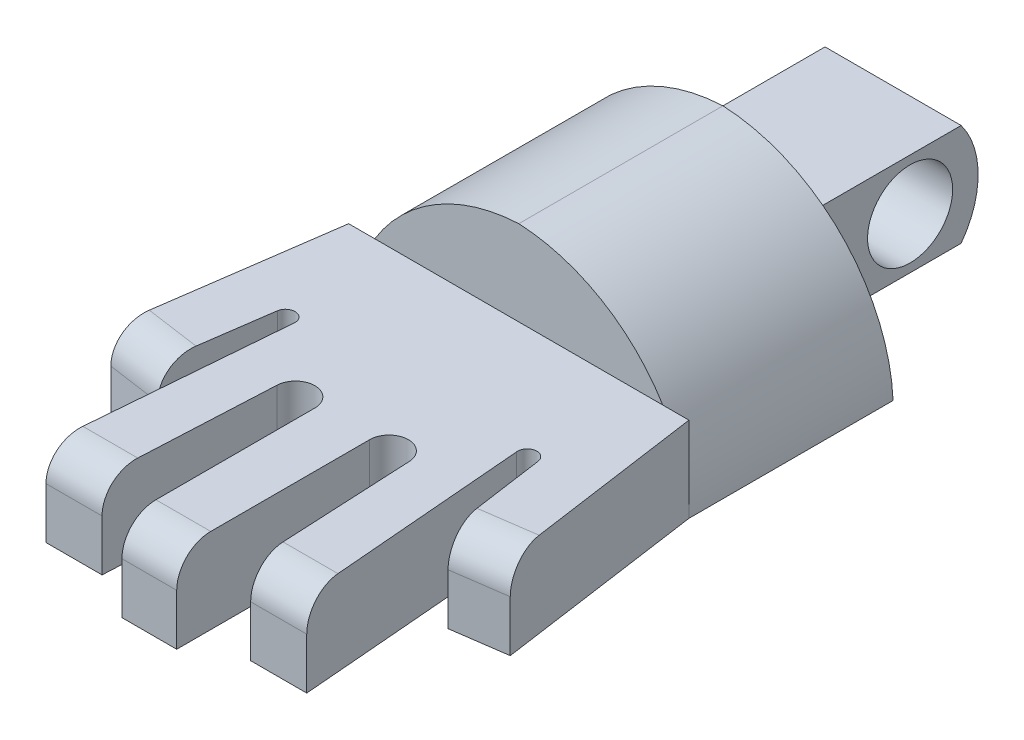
ISO-10303-21;
HEADER;
FILE_DESCRIPTION(('STEP AP214'),'2;1');
FILE_NAME('part.step','',(''),(''),'','','');
FILE_SCHEMA(('AUTOMOTIVE_DESIGN { 1 0 10303 214 1 1 1 1 }'));
ENDSEC;
DATA;
#1=APPLICATION_CONTEXT('core data for automotive mechanical design processes');
#2=APPLICATION_PROTOCOL_DEFINITION('international standard','automotive_design',2000,#1);
#3=PRODUCT_CONTEXT('',#1,'mechanical');
#4=PRODUCT('Part','Part','',(#3));
#5=PRODUCT_RELATED_PRODUCT_CATEGORY('part','',(#4));
#6=PRODUCT_DEFINITION_FORMATION('','',#4);
#7=PRODUCT_DEFINITION_CONTEXT('part definition',#1,'design');
#8=PRODUCT_DEFINITION('design','',#6,#7);
#9=PRODUCT_DEFINITION_SHAPE('','',#8);
#10=(LENGTH_UNIT() NAMED_UNIT(*) SI_UNIT(.MILLI.,.METRE.));
#11=(NAMED_UNIT(*) PLANE_ANGLE_UNIT() SI_UNIT($,.RADIAN.));
#12=(NAMED_UNIT(*) SI_UNIT($,.STERADIAN.) SOLID_ANGLE_UNIT());
#13=UNCERTAINTY_MEASURE_WITH_UNIT(LENGTH_MEASURE(1.E-05),#10,'distance_accuracy_value','');
#14=(GEOMETRIC_REPRESENTATION_CONTEXT(3) GLOBAL_UNCERTAINTY_ASSIGNED_CONTEXT((#13)) GLOBAL_UNIT_ASSIGNED_CONTEXT((#10,
#11,#12)) REPRESENTATION_CONTEXT('',''));
#15=CARTESIAN_POINT('',(0.,0.,0.));
#16=DIRECTION('',(0.,0.,1.));
#17=DIRECTION('',(1.,0.,0.));
#18=AXIS2_PLACEMENT_3D('',#15,#16,#17);
#19=CARTESIAN_POINT('',(0.482716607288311,-0.482716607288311,0.));
#20=DIRECTION('',(0.,0.,1.));
#21=DIRECTION('',(1.,0.,0.));
#22=AXIS2_PLACEMENT_3D('',#19,#20,#21);
#23=PLANE('',#22);
#24=DIRECTION('',(0.,-1.,0.));
#25=VECTOR('',#24,1.);
#26=CARTESIAN_POINT('',(4.,6.,0.));
#27=LINE('',#26,#25);
#28=CARTESIAN_POINT('',(4.,6.,0.));
#29=VERTEX_POINT('',#28);
#30=CARTESIAN_POINT('',(4.,0.,0.));
#31=VERTEX_POINT('',#30);
#32=EDGE_CURVE('E291',#29,#31,#27,.T.);
#33=ORIENTED_EDGE('',*,*,#32,.F.);
#34=DIRECTION('',(1.,0.,0.));
#35=VECTOR('',#34,1.);
#36=CARTESIAN_POINT('',(-4.,6.,0.));
#37=LINE('',#36,#35);
#38=CARTESIAN_POINT('',(-4.,6.,0.));
#39=VERTEX_POINT('',#38);
#40=EDGE_CURVE('E333',#39,#29,#37,.T.);
#41=ORIENTED_EDGE('',*,*,#40,.F.);
#42=DIRECTION('',(0.,-1.,0.));
#43=VECTOR('',#42,1.);
#44=CARTESIAN_POINT('',(-4.,6.,0.));
#45=LINE('',#44,#43);
#46=CARTESIAN_POINT('',(-4.,0.,0.));
#47=VERTEX_POINT('',#46);
#48=EDGE_CURVE('E316',#39,#47,#45,.T.);
#49=ORIENTED_EDGE('',*,*,#48,.T.);
#50=DIRECTION('',(1.,0.,0.));
#51=VECTOR('',#50,1.);
#52=CARTESIAN_POINT('',(10.,0.,0.));
#53=LINE('',#52,#51);
#54=CARTESIAN_POINT('',(-10.,0.,0.));
#55=VERTEX_POINT('',#54);
#56=EDGE_CURVE('E355',#55,#47,#53,.T.);
#57=ORIENTED_EDGE('',*,*,#56,.F.);
#58=CARTESIAN_POINT('',(0.482716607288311,-0.482716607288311,0.));
#59=DIRECTION('',(0.,0.,1.));
#60=DIRECTION('',(1.,0.,0.));
#61=AXIS2_PLACEMENT_3D('',#58,#59,#60);
#62=CIRCLE('',#61,10.4938249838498);
#63=CARTESIAN_POINT('',(0.,10.,0.));
#64=VERTEX_POINT('',#63);
#65=EDGE_CURVE('E336',#64,#55,#62,.T.);
#66=ORIENTED_EDGE('',*,*,#65,.F.);
#67=CARTESIAN_POINT('',(-0.482716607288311,-0.482716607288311,0.));
#68=DIRECTION('',(0.,0.,1.));
#69=DIRECTION('',(-1.,0.,0.));
#70=AXIS2_PLACEMENT_3D('',#67,#68,#69);
#71=CIRCLE('',#70,10.4938249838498);
#72=CARTESIAN_POINT('',(10.,0.,0.));
#73=VERTEX_POINT('',#72);
#74=EDGE_CURVE('E359',#73,#64,#71,.T.);
#75=ORIENTED_EDGE('',*,*,#74,.F.);
#76=EDGE_CURVE('E354',#31,#73,#53,.T.);
#77=ORIENTED_EDGE('',*,*,#76,.F.);
#78=EDGE_LOOP('',(#33,#41,#49,#57,#66,#75,#77));
#79=FACE_BOUND('',#78,.T.);
#80=ADVANCED_FACE('F45',(#79),#23,.F.);
#81=CARTESIAN_POINT('',(0.482716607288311,-0.482716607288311,12.));
#82=DIRECTION('',(0.,0.,-1.));
#83=DIRECTION('',(-1.,0.,0.));
#84=AXIS2_PLACEMENT_3D('',#81,#82,#83);
#85=CYLINDRICAL_SURFACE('',#84,10.4938249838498);
#86=ORIENTED_EDGE('',*,*,#65,.T.);
#87=DIRECTION('',(0.,0.,-1.));
#88=VECTOR('',#87,1.);
#89=CARTESIAN_POINT('',(-10.,0.,12.));
#90=LINE('',#89,#88);
#91=CARTESIAN_POINT('',(-10.,0.,12.));
#92=VERTEX_POINT('',#91);
#93=EDGE_CURVE('E369',#92,#55,#90,.T.);
#94=ORIENTED_EDGE('',*,*,#93,.F.);
#95=CARTESIAN_POINT('',(0.482716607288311,-0.482716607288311,12.));
#96=DIRECTION('',(0.,0.,1.));
#97=DIRECTION('',(1.,0.,0.));
#98=AXIS2_PLACEMENT_3D('',#95,#96,#97);
#99=CIRCLE('',#98,10.4938249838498);
#100=CARTESIAN_POINT('',(-8.46491891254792,5.,12.));
#101=VERTEX_POINT('',#100);
#102=EDGE_CURVE('E282',#101,#92,#99,.T.);
#103=ORIENTED_EDGE('',*,*,#102,.F.);
#104=CARTESIAN_POINT('',(0.,10.,12.));
#105=VERTEX_POINT('',#104);
#106=EDGE_CURVE('E342',#105,#101,#99,.T.);
#107=ORIENTED_EDGE('',*,*,#106,.F.);
#108=DIRECTION('',(0.,0.,-1.));
#109=VECTOR('',#108,1.);
#110=CARTESIAN_POINT('',(0.,10.,12.));
#111=LINE('',#110,#109);
#112=EDGE_CURVE('E350',#105,#64,#111,.T.);
#113=ORIENTED_EDGE('',*,*,#112,.T.);
#114=EDGE_LOOP('',(#86,#94,#103,#107,#113));
#115=FACE_BOUND('',#114,.T.);
#116=ADVANCED_FACE('F448',(#115),#85,.T.);
#117=CARTESIAN_POINT('',(10.,0.,12.));
#118=DIRECTION('',(0.,1.,0.));
#119=DIRECTION('',(0.,0.,1.));
#120=AXIS2_PLACEMENT_3D('',#117,#118,#119);
#121=PLANE('',#120);
#122=ORIENTED_EDGE('',*,*,#56,.T.);
#123=DIRECTION('',(0.,0.,-1.));
#124=VECTOR('',#123,1.);
#125=CARTESIAN_POINT('',(-4.,0.,0.));
#126=LINE('',#125,#124);
#127=CARTESIAN_POINT('',(-4.,0.,-10.));
#128=VERTEX_POINT('',#127);
#129=EDGE_CURVE('E320',#47,#128,#126,.T.);
#130=ORIENTED_EDGE('',*,*,#129,.T.);
#131=DIRECTION('',(1.,0.,0.));
#132=VECTOR('',#131,1.);
#133=CARTESIAN_POINT('',(-4.,0.,-10.));
#134=LINE('',#133,#132);
#135=CARTESIAN_POINT('',(4.,0.,-10.));
#136=VERTEX_POINT('',#135);
#137=EDGE_CURVE('E332',#128,#136,#134,.T.);
#138=ORIENTED_EDGE('',*,*,#137,.T.);
#139=DIRECTION('',(0.,0.,-1.));
#140=VECTOR('',#139,1.);
#141=CARTESIAN_POINT('',(4.,0.,0.));
#142=LINE('',#141,#140);
#143=EDGE_CURVE('E300',#31,#136,#142,.T.);
#144=ORIENTED_EDGE('',*,*,#143,.F.);
#145=ORIENTED_EDGE('',*,*,#76,.T.);
#146=DIRECTION('',(0.,0.,-1.));
#147=VECTOR('',#146,1.);
#148=CARTESIAN_POINT('',(10.,0.,12.));
#149=LINE('',#148,#147);
#150=CARTESIAN_POINT('',(10.,0.,12.));
#151=VERTEX_POINT('',#150);
#152=EDGE_CURVE('E365',#151,#73,#149,.T.);
#153=ORIENTED_EDGE('',*,*,#152,.F.);
#154=DIRECTION('',(-0.140578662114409,0.,-0.990069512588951));
#155=VECTOR('',#154,1.);
#156=CARTESIAN_POINT('',(10.,0.,12.));
#157=LINE('',#156,#155);
#158=CARTESIAN_POINT('',(11.7380220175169,0.,24.240567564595));
#159=VERTEX_POINT('',#158);
#160=EDGE_CURVE('E267',#159,#151,#157,.T.);
#161=ORIENTED_EDGE('',*,*,#160,.F.);
#162=DIRECTION('',(0.990069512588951,0.,-0.140578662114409));
#163=VECTOR('',#162,1.);
#164=CARTESIAN_POINT('',(11.7380220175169,0.,24.240567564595));
#165=LINE('',#164,#163);
#166=CARTESIAN_POINT('',(8.53819632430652,0.,24.6949065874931));
#167=VERTEX_POINT('',#166);
#168=EDGE_CURVE('E561',#167,#159,#165,.T.);
#169=ORIENTED_EDGE('',*,*,#168,.F.);
#170=DIRECTION('',(0.140578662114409,0.,0.990069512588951));
#171=VECTOR('',#170,1.);
#172=CARTESIAN_POINT('',(8.53819632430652,0.,24.6949065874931));
#173=LINE('',#172,#171);
#174=CARTESIAN_POINT('',(7.66296972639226,0.,18.5308475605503));
#175=VERTEX_POINT('',#174);
#176=EDGE_CURVE('E557',#175,#167,#173,.T.);
#177=ORIENTED_EDGE('',*,*,#176,.F.);
#178=CARTESIAN_POINT('',(7.10640066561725,0.,18.6098740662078));
#179=DIRECTION('',(0.,-1.,0.));
#180=DIRECTION('',(0.,0.,1.));
#181=AXIS2_PLACEMENT_3D('',#178,#179,#180);
#182=CIRCLE('',#181,0.562151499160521);
#183=CARTESIAN_POINT('',(6.54983160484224,0.,18.6889005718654));
#184=VERTEX_POINT('',#183);
#185=EDGE_CURVE('E554',#184,#175,#182,.T.);
#186=ORIENTED_EDGE('',*,*,#185,.F.);
#187=DIRECTION('',(-0.0825527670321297,0.,-0.996586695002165));
#188=VECTOR('',#187,1.);
#189=CARTESIAN_POINT('',(6.54983160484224,0.,18.6889005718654));
#190=LINE('',#189,#188);
#191=CARTESIAN_POINT('',(7.66296972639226,0.,32.1268346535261));
#192=VERTEX_POINT('',#191);
#193=EDGE_CURVE('E551',#192,#184,#190,.T.);
#194=ORIENTED_EDGE('',*,*,#193,.F.);
#195=DIRECTION('',(1.,0.,0.));
#196=VECTOR('',#195,1.);
#197=CARTESIAN_POINT('',(7.66296972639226,0.,32.1268346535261));
#198=LINE('',#197,#196);
#199=CARTESIAN_POINT('',(4.36855746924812,0.,32.1268346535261));
#200=VERTEX_POINT('',#199);
#201=EDGE_CURVE('E547',#200,#192,#198,.T.);
#202=ORIENTED_EDGE('',*,*,#201,.F.);
#203=DIRECTION('',(0.0492084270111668,0.,0.998788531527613));
#204=VECTOR('',#203,1.);
#205=CARTESIAN_POINT('',(4.36855746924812,0.,32.1268346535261));
#206=LINE('',#205,#204);
#207=CARTESIAN_POINT('',(3.88537198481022,0.,22.3195689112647));
#208=VERTEX_POINT('',#207);
#209=EDGE_CURVE('E543',#208,#200,#206,.T.);
#210=ORIENTED_EDGE('',*,*,#209,.F.);
#211=CARTESIAN_POINT('',(2.74860314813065,0.,22.3755753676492));
#212=DIRECTION('',(0.,-1.,0.));
#213=DIRECTION('',(0.,0.,1.));
#214=AXIS2_PLACEMENT_3D('',#211,#212,#213);
#215=CIRCLE('',#214,1.13814766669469);
#216=CARTESIAN_POINT('',(1.61045551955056,0.,22.3758699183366));
#217=VERTEX_POINT('',#216);
#218=EDGE_CURVE('E540',#217,#208,#215,.T.);
#219=ORIENTED_EDGE('',*,*,#218,.F.);
#220=DIRECTION('',(0.,0.,-1.));
#221=VECTOR('',#220,1.);
#222=CARTESIAN_POINT('',(1.61045551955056,0.,22.3758699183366));
#223=LINE('',#222,#221);
#224=CARTESIAN_POINT('',(1.61045551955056,0.,33.7168999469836));
#225=VERTEX_POINT('',#224);
#226=EDGE_CURVE('E537',#225,#217,#223,.T.);
#227=ORIENTED_EDGE('',*,*,#226,.F.);
#228=DIRECTION('',(1.,0.,0.));
#229=VECTOR('',#228,1.);
#230=CARTESIAN_POINT('',(-1.61045551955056,0.,33.7168999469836));
#231=LINE('',#230,#229);
#232=CARTESIAN_POINT('',(-1.61045551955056,0.,33.7168999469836));
#233=VERTEX_POINT('',#232);
#234=EDGE_CURVE('E533',#233,#225,#231,.T.);
#235=ORIENTED_EDGE('',*,*,#234,.F.);
#236=DIRECTION('',(0.,0.,1.));
#237=VECTOR('',#236,1.);
#238=CARTESIAN_POINT('',(-1.61045551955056,0.,22.3758699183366));
#239=LINE('',#238,#237);
#240=CARTESIAN_POINT('',(-1.61045551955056,0.,22.3758699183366));
#241=VERTEX_POINT('',#240);
#242=EDGE_CURVE('E529',#241,#233,#239,.T.);
#243=ORIENTED_EDGE('',*,*,#242,.F.);
#244=CARTESIAN_POINT('',(-2.74860314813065,0.,22.3755753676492));
#245=DIRECTION('',(0.,-1.,0.));
#246=DIRECTION('',(0.,0.,-1.));
#247=AXIS2_PLACEMENT_3D('',#244,#245,#246);
#248=CIRCLE('',#247,1.13814766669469);
#249=CARTESIAN_POINT('',(-3.88537198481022,0.,22.3195689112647));
#250=VERTEX_POINT('',#249);
#251=EDGE_CURVE('E526',#250,#241,#248,.T.);
#252=ORIENTED_EDGE('',*,*,#251,.F.);
#253=DIRECTION('',(0.0492084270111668,0.,-0.998788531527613));
#254=VECTOR('',#253,1.);
#255=CARTESIAN_POINT('',(-4.36855746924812,0.,32.1268346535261));
#256=LINE('',#255,#254);
#257=CARTESIAN_POINT('',(-4.36855746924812,0.,32.1268346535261));
#258=VERTEX_POINT('',#257);
#259=EDGE_CURVE('E523',#258,#250,#256,.T.);
#260=ORIENTED_EDGE('',*,*,#259,.F.);
#261=DIRECTION('',(1.,0.,0.));
#262=VECTOR('',#261,1.);
#263=CARTESIAN_POINT('',(-7.66296972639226,0.,32.1268346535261));
#264=LINE('',#263,#262);
#265=CARTESIAN_POINT('',(-7.66296972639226,0.,32.1268346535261));
#266=VERTEX_POINT('',#265);
#267=EDGE_CURVE('E519',#266,#258,#264,.T.);
#268=ORIENTED_EDGE('',*,*,#267,.F.);
#269=DIRECTION('',(-0.0825527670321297,0.,0.996586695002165));
#270=VECTOR('',#269,1.);
#271=CARTESIAN_POINT('',(-6.54983160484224,0.,18.6889005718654));
#272=LINE('',#271,#270);
#273=CARTESIAN_POINT('',(-6.54983160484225,0.,18.6889005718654));
#274=VERTEX_POINT('',#273);
#275=EDGE_CURVE('E515',#274,#266,#272,.T.);
#276=ORIENTED_EDGE('',*,*,#275,.F.);
#277=CARTESIAN_POINT('',(-7.10640066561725,0.,18.6098740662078));
#278=DIRECTION('',(0.,-1.,0.));
#279=DIRECTION('',(0.,0.,-1.));
#280=AXIS2_PLACEMENT_3D('',#277,#278,#279);
#281=CIRCLE('',#280,0.562151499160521);
#282=CARTESIAN_POINT('',(-7.66296972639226,0.,18.5308475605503));
#283=VERTEX_POINT('',#282);
#284=EDGE_CURVE('E512',#283,#274,#281,.T.);
#285=ORIENTED_EDGE('',*,*,#284,.F.);
#286=DIRECTION('',(0.140578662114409,0.,-0.990069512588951));
#287=VECTOR('',#286,1.);
#288=CARTESIAN_POINT('',(-8.53819632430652,0.,24.6949065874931));
#289=LINE('',#288,#287);
#290=CARTESIAN_POINT('',(-8.53819632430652,0.,24.6949065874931));
#291=VERTEX_POINT('',#290);
#292=EDGE_CURVE('E509',#291,#283,#289,.T.);
#293=ORIENTED_EDGE('',*,*,#292,.F.);
#294=DIRECTION('',(0.990069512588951,0.,0.140578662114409));
#295=VECTOR('',#294,1.);
#296=CARTESIAN_POINT('',(-11.7380220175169,0.,24.240567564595));
#297=LINE('',#296,#295);
#298=CARTESIAN_POINT('',(-11.7380220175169,0.,24.240567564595));
#299=VERTEX_POINT('',#298);
#300=EDGE_CURVE('E505',#299,#291,#297,.T.);
#301=ORIENTED_EDGE('',*,*,#300,.F.);
#302=DIRECTION('',(-0.140578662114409,0.,0.990069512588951));
#303=VECTOR('',#302,1.);
#304=CARTESIAN_POINT('',(-10.,0.,12.));
#305=LINE('',#304,#303);
#306=EDGE_CURVE('E502',#92,#299,#305,.T.);
#307=ORIENTED_EDGE('',*,*,#306,.F.);
#308=ORIENTED_EDGE('',*,*,#93,.T.);
#309=EDGE_LOOP('',(#122,#130,#138,#144,#145,#153,#161,#169,#177,#186,#194,#202,#210,#219,#227,
#235,#243,#252,#260,#268,#276,#285,#293,#301,#307,#308));
#310=FACE_BOUND('',#309,.T.);
#311=ADVANCED_FACE('F435',(#310),#121,.F.);
#312=CARTESIAN_POINT('',(-0.482716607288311,-0.482716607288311,12.));
#313=DIRECTION('',(0.,0.,-1.));
#314=DIRECTION('',(-1.,0.,0.));
#315=AXIS2_PLACEMENT_3D('',#312,#313,#314);
#316=CYLINDRICAL_SURFACE('',#315,10.4938249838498);
#317=ORIENTED_EDGE('',*,*,#74,.T.);
#318=ORIENTED_EDGE('',*,*,#112,.F.);
#319=CARTESIAN_POINT('',(-0.482716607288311,-0.482716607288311,12.));
#320=DIRECTION('',(0.,0.,1.));
#321=DIRECTION('',(-1.,0.,0.));
#322=AXIS2_PLACEMENT_3D('',#319,#320,#321);
#323=CIRCLE('',#322,10.4938249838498);
#324=CARTESIAN_POINT('',(8.46491891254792,5.,12.));
#325=VERTEX_POINT('',#324);
#326=EDGE_CURVE('E345',#325,#105,#323,.T.);
#327=ORIENTED_EDGE('',*,*,#326,.F.);
#328=EDGE_CURVE('E346',#151,#325,#323,.T.);
#329=ORIENTED_EDGE('',*,*,#328,.F.);
#330=ORIENTED_EDGE('',*,*,#152,.T.);
#331=EDGE_LOOP('',(#317,#318,#327,#329,#330));
#332=FACE_BOUND('',#331,.T.);
#333=ADVANCED_FACE('F442',(#332),#316,.T.);
#334=CARTESIAN_POINT('',(0.482716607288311,-0.482716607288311,12.));
#335=DIRECTION('',(0.,0.,1.));
#336=DIRECTION('',(1.,0.,0.));
#337=AXIS2_PLACEMENT_3D('',#334,#335,#336);
#338=PLANE('',#337);
#339=DIRECTION('',(-1.,0.,0.));
#340=VECTOR('',#339,1.);
#341=CARTESIAN_POINT('',(-10.,5.,12.));
#342=LINE('',#341,#340);
#343=EDGE_CURVE('E261',#325,#101,#342,.T.);
#344=ORIENTED_EDGE('',*,*,#343,.F.);
#345=ORIENTED_EDGE('',*,*,#326,.T.);
#346=ORIENTED_EDGE('',*,*,#106,.T.);
#347=EDGE_LOOP('',(#344,#345,#346));
#348=FACE_BOUND('',#347,.T.);
#349=ADVANCED_FACE('F664',(#348),#338,.T.);
#350=CARTESIAN_POINT('',(-4.,6.,0.));
#351=DIRECTION('',(0.,1.,0.));
#352=DIRECTION('',(0.,0.,1.));
#353=AXIS2_PLACEMENT_3D('',#350,#351,#352);
#354=PLANE('',#353);
#355=ORIENTED_EDGE('',*,*,#40,.T.);
#356=DIRECTION('',(0.,0.,1.));
#357=VECTOR('',#356,1.);
#358=CARTESIAN_POINT('',(4.,6.,0.));
#359=LINE('',#358,#357);
#360=CARTESIAN_POINT('',(4.,6.,-10.));
#361=VERTEX_POINT('',#360);
#362=EDGE_CURVE('E308',#361,#29,#359,.T.);
#363=ORIENTED_EDGE('',*,*,#362,.F.);
#364=DIRECTION('',(1.,0.,0.));
#365=VECTOR('',#364,1.);
#366=CARTESIAN_POINT('',(-4.,6.,-10.));
#367=LINE('',#366,#365);
#368=CARTESIAN_POINT('',(-4.,6.,-10.));
#369=VERTEX_POINT('',#368);
#370=EDGE_CURVE('E337',#369,#361,#367,.T.);
#371=ORIENTED_EDGE('',*,*,#370,.F.);
#372=DIRECTION('',(0.,0.,1.));
#373=VECTOR('',#372,1.);
#374=CARTESIAN_POINT('',(-4.,6.,0.));
#375=LINE('',#374,#373);
#376=EDGE_CURVE('E328',#369,#39,#375,.T.);
#377=ORIENTED_EDGE('',*,*,#376,.T.);
#378=EDGE_LOOP('',(#355,#363,#371,#377));
#379=FACE_BOUND('',#378,.T.);
#380=ADVANCED_FACE('F793',(#379),#354,.T.);
#381=CARTESIAN_POINT('',(-4.,3.,-6.));
#382=DIRECTION('',(1.,0.,0.));
#383=DIRECTION('',(0.,0.,-1.));
#384=AXIS2_PLACEMENT_3D('',#381,#382,#383);
#385=CYLINDRICAL_SURFACE('',#384,5.);
#386=ORIENTED_EDGE('',*,*,#370,.T.);
#387=CARTESIAN_POINT('',(4.,3.,-6.));
#388=DIRECTION('',(1.,0.,0.));
#389=DIRECTION('',(0.,0.,1.));
#390=AXIS2_PLACEMENT_3D('',#387,#388,#389);
#391=CIRCLE('',#390,5.);
#392=EDGE_CURVE('E304',#136,#361,#391,.T.);
#393=ORIENTED_EDGE('',*,*,#392,.F.);
#394=ORIENTED_EDGE('',*,*,#137,.F.);
#395=CARTESIAN_POINT('',(-4.,3.,-6.));
#396=DIRECTION('',(1.,0.,0.));
#397=DIRECTION('',(0.,0.,1.));
#398=AXIS2_PLACEMENT_3D('',#395,#396,#397);
#399=CIRCLE('',#398,5.);
#400=EDGE_CURVE('E324',#128,#369,#399,.T.);
#401=ORIENTED_EDGE('',*,*,#400,.T.);
#402=EDGE_LOOP('',(#386,#393,#394,#401));
#403=FACE_BOUND('',#402,.T.);
#404=ADVANCED_FACE('F791',(#403),#385,.T.);
#405=CARTESIAN_POINT('',(-4.,3.,-6.));
#406=DIRECTION('',(-1.,0.,0.));
#407=DIRECTION('',(0.,0.,1.));
#408=AXIS2_PLACEMENT_3D('',#405,#406,#407);
#409=PLANE('',#408);
#410=CARTESIAN_POINT('',(-4.,3.,-7.));
#411=DIRECTION('',(1.,0.,0.));
#412=DIRECTION('',(0.,0.,-1.));
#413=AXIS2_PLACEMENT_3D('',#410,#411,#412);
#414=CIRCLE('',#413,2.5);
#415=CARTESIAN_POINT('',(-4.,3.,-9.5));
#416=VERTEX_POINT('',#415);
#417=EDGE_CURVE('E312',#416,#416,#414,.T.);
#418=ORIENTED_EDGE('',*,*,#417,.T.);
#419=EDGE_LOOP('',(#418));
#420=FACE_BOUND('',#419,.T.);
#421=ORIENTED_EDGE('',*,*,#48,.F.);
#422=ORIENTED_EDGE('',*,*,#376,.F.);
#423=ORIENTED_EDGE('',*,*,#400,.F.);
#424=ORIENTED_EDGE('',*,*,#129,.F.);
#425=EDGE_LOOP('',(#421,#422,#423,#424));
#426=FACE_BOUND('',#425,.T.);
#427=ADVANCED_FACE('F787',(#420,#426),#409,.T.);
#428=CARTESIAN_POINT('',(-4.,3.,-7.));
#429=DIRECTION('',(1.,0.,0.));
#430=DIRECTION('',(0.,0.,-1.));
#431=AXIS2_PLACEMENT_3D('',#428,#429,#430);
#432=CYLINDRICAL_SURFACE('',#431,2.5);
#433=ORIENTED_EDGE('',*,*,#417,.F.);
#434=EDGE_LOOP('',(#433));
#435=FACE_BOUND('',#434,.T.);
#436=CARTESIAN_POINT('',(4.,3.,-7.));
#437=DIRECTION('',(1.,0.,0.));
#438=DIRECTION('',(0.,0.,-1.));
#439=AXIS2_PLACEMENT_3D('',#436,#437,#438);
#440=CIRCLE('',#439,2.5);
#441=CARTESIAN_POINT('',(4.,3.,-9.5));
#442=VERTEX_POINT('',#441);
#443=EDGE_CURVE('E285',#442,#442,#440,.T.);
#444=ORIENTED_EDGE('',*,*,#443,.T.);
#445=EDGE_LOOP('',(#444));
#446=FACE_BOUND('',#445,.T.);
#447=ADVANCED_FACE('F783',(#435,#446),#432,.F.);
#448=CARTESIAN_POINT('',(4.,3.,-6.));
#449=DIRECTION('',(-1.,0.,0.));
#450=DIRECTION('',(0.,0.,1.));
#451=AXIS2_PLACEMENT_3D('',#448,#449,#450);
#452=PLANE('',#451);
#453=ORIENTED_EDGE('',*,*,#32,.T.);
#454=ORIENTED_EDGE('',*,*,#143,.T.);
#455=ORIENTED_EDGE('',*,*,#392,.T.);
#456=ORIENTED_EDGE('',*,*,#362,.T.);
#457=EDGE_LOOP('',(#453,#454,#455,#456));
#458=FACE_BOUND('',#457,.T.);
#459=ORIENTED_EDGE('',*,*,#443,.F.);
#460=EDGE_LOOP('',(#459));
#461=FACE_BOUND('',#460,.T.);
#462=ADVANCED_FACE('F780',(#458,#461),#452,.F.);
#463=CARTESIAN_POINT('',(-10.,5.,12.));
#464=DIRECTION('',(0.,0.,1.));
#465=DIRECTION('',(1.,0.,0.));
#466=AXIS2_PLACEMENT_3D('',#463,#464,#465);
#467=PLANE('',#466);
#468=CARTESIAN_POINT('',(-10.,5.,12.));
#469=VERTEX_POINT('',#468);
#470=EDGE_CURVE('E254',#101,#469,#342,.T.);
#471=ORIENTED_EDGE('',*,*,#470,.F.);
#472=ORIENTED_EDGE('',*,*,#102,.T.);
#473=DIRECTION('',(0.,-1.,0.));
#474=VECTOR('',#473,1.);
#475=CARTESIAN_POINT('',(-10.,5.,12.));
#476=LINE('',#475,#474);
#477=EDGE_CURVE('E274',#469,#92,#476,.T.);
#478=ORIENTED_EDGE('',*,*,#477,.F.);
#479=EDGE_LOOP('',(#471,#472,#478));
#480=FACE_BOUND('',#479,.T.);
#481=ADVANCED_FACE('F280',(#480),#467,.F.);
#482=DIRECTION('',(0.,-1.,0.));
#483=VECTOR('',#482,1.);
#484=CARTESIAN_POINT('',(10.,5.,12.));
#485=LINE('',#484,#483);
#486=CARTESIAN_POINT('',(10.,5.,12.));
#487=VERTEX_POINT('',#486);
#488=EDGE_CURVE('E456',#487,#151,#485,.T.);
#489=ORIENTED_EDGE('',*,*,#488,.T.);
#490=ORIENTED_EDGE('',*,*,#328,.T.);
#491=EDGE_CURVE('E266',#487,#325,#342,.T.);
#492=ORIENTED_EDGE('',*,*,#491,.F.);
#493=EDGE_LOOP('',(#489,#490,#492));
#494=FACE_BOUND('',#493,.T.);
#495=ADVANCED_FACE('F454',(#494),#467,.F.);
#496=CARTESIAN_POINT('',(-10.,5.,12.));
#497=DIRECTION('',(0.990069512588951,0.,0.140578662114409));
#498=DIRECTION('',(0.140578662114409,0.,-0.990069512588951));
#499=AXIS2_PLACEMENT_3D('',#496,#497,#498);
#500=PLANE('',#499);
#501=DIRECTION('',(0.,-1.,0.));
#502=VECTOR('',#501,1.);
#503=CARTESIAN_POINT('',(-11.7380220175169,5.,24.240567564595));
#504=LINE('',#503,#502);
#505=CARTESIAN_POINT('',(-11.7380220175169,3.,24.240567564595));
#506=VERTEX_POINT('',#505);
#507=EDGE_CURVE('E286',#506,#299,#504,.T.);
#508=ORIENTED_EDGE('',*,*,#507,.F.);
#509=CARTESIAN_POINT('',(-11.456864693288,3.,22.2604285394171));
#510=DIRECTION('',(0.990069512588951,0.,0.140578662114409));
#511=DIRECTION('',(0.140578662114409,0.,-0.990069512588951));
#512=AXIS2_PLACEMENT_3D('',#509,#510,#511);
#513=CIRCLE('',#512,2.);
#514=CARTESIAN_POINT('',(-11.4568646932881,5.,22.2604285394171));
#515=VERTEX_POINT('',#514);
#516=EDGE_CURVE('E276',#506,#515,#513,.F.);
#517=ORIENTED_EDGE('',*,*,#516,.T.);
#518=DIRECTION('',(-0.140578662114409,0.,0.990069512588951));
#519=VECTOR('',#518,1.);
#520=CARTESIAN_POINT('',(-10.,5.,12.));
#521=LINE('',#520,#519);
#522=EDGE_CURVE('E258',#469,#515,#521,.T.);
#523=ORIENTED_EDGE('',*,*,#522,.F.);
#524=ORIENTED_EDGE('',*,*,#477,.T.);
#525=ORIENTED_EDGE('',*,*,#306,.T.);
#526=EDGE_LOOP('',(#508,#517,#523,#524,#525));
#527=FACE_BOUND('',#526,.T.);
#528=ADVANCED_FACE('F272',(#527),#500,.F.);
#529=CARTESIAN_POINT('',(-11.7380220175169,5.,24.240567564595));
#530=DIRECTION('',(0.140578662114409,0.,-0.990069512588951));
#531=DIRECTION('',(-0.990069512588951,0.,-0.140578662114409));
#532=AXIS2_PLACEMENT_3D('',#529,#530,#531);
#533=PLANE('',#532);
#534=DIRECTION('',(0.,-1.,0.));
#535=VECTOR('',#534,1.);
#536=CARTESIAN_POINT('',(-8.53819632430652,5.,24.6949065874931));
#537=LINE('',#536,#535);
#538=CARTESIAN_POINT('',(-8.53819632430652,3.,24.6949065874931));
#539=VERTEX_POINT('',#538);
#540=EDGE_CURVE('E293',#539,#291,#537,.T.);
#541=ORIENTED_EDGE('',*,*,#540,.F.);
#542=DIRECTION('',(0.990069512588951,0.,0.140578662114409));
#543=VECTOR('',#542,1.);
#544=CARTESIAN_POINT('',(-11.7380220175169,3.,24.240567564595));
#545=LINE('',#544,#543);
#546=EDGE_CURVE('E395',#539,#506,#545,.F.);
#547=ORIENTED_EDGE('',*,*,#546,.T.);
#548=ORIENTED_EDGE('',*,*,#507,.T.);
#549=ORIENTED_EDGE('',*,*,#300,.T.);
#550=EDGE_LOOP('',(#541,#547,#548,#549));
#551=FACE_BOUND('',#550,.T.);
#552=ADVANCED_FACE('F634',(#551),#533,.F.);
#553=CARTESIAN_POINT('',(-8.53819632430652,5.,24.6949065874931));
#554=DIRECTION('',(-0.990069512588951,0.,-0.140578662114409));
#555=DIRECTION('',(-0.140578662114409,0.,0.990069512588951));
#556=AXIS2_PLACEMENT_3D('',#553,#554,#555);
#557=PLANE('',#556);
#558=DIRECTION('',(0.140578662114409,0.,-0.990069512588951));
#559=VECTOR('',#558,1.);
#560=CARTESIAN_POINT('',(-8.53819632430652,5.,24.6949065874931));
#561=LINE('',#560,#559);
#562=CARTESIAN_POINT('',(-8.2570390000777,5.,22.7147675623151));
#563=VERTEX_POINT('',#562);
#564=CARTESIAN_POINT('',(-7.66296972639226,5.,18.5308475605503));
#565=VERTEX_POINT('',#564);
#566=EDGE_CURVE('E278',#563,#565,#561,.T.);
#567=ORIENTED_EDGE('',*,*,#566,.F.);
#568=CARTESIAN_POINT('',(-8.2570390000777,3.,22.7147675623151));
#569=DIRECTION('',(-0.990069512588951,0.,-0.140578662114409));
#570=DIRECTION('',(-0.140578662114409,0.,0.990069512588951));
#571=AXIS2_PLACEMENT_3D('',#568,#569,#570);
#572=CIRCLE('',#571,2.);
#573=EDGE_CURVE('E392',#563,#539,#572,.F.);
#574=ORIENTED_EDGE('',*,*,#573,.T.);
#575=ORIENTED_EDGE('',*,*,#540,.T.);
#576=ORIENTED_EDGE('',*,*,#292,.T.);
#577=DIRECTION('',(0.,-1.,0.));
#578=VECTOR('',#577,1.);
#579=CARTESIAN_POINT('',(-7.66296972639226,5.,18.5308475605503));
#580=LINE('',#579,#578);
#581=EDGE_CURVE('E621',#565,#283,#580,.T.);
#582=ORIENTED_EDGE('',*,*,#581,.F.);
#583=EDGE_LOOP('',(#567,#574,#575,#576,#582));
#584=FACE_BOUND('',#583,.T.);
#585=ADVANCED_FACE('F628',(#584),#557,.F.);
#586=CARTESIAN_POINT('',(-7.10640066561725,5.,18.6098740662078));
#587=DIRECTION('',(0.,-1.,0.));
#588=DIRECTION('',(0.,0.,-1.));
#589=AXIS2_PLACEMENT_3D('',#586,#587,#588);
#590=CYLINDRICAL_SURFACE('',#589,0.562151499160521);
#591=ORIENTED_EDGE('',*,*,#284,.T.);
#592=DIRECTION('',(0.,-1.,0.));
#593=VECTOR('',#592,1.);
#594=CARTESIAN_POINT('',(-6.54983160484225,5.,18.6889005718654));
#595=LINE('',#594,#593);
#596=CARTESIAN_POINT('',(-6.54983160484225,5.,18.6889005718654));
#597=VERTEX_POINT('',#596);
#598=EDGE_CURVE('E617',#597,#274,#595,.T.);
#599=ORIENTED_EDGE('',*,*,#598,.F.);
#600=CARTESIAN_POINT('',(-7.10640066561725,5.,18.6098740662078));
#601=DIRECTION('',(0.,-1.,0.));
#602=DIRECTION('',(0.,0.,-1.));
#603=AXIS2_PLACEMENT_3D('',#600,#601,#602);
#604=CIRCLE('',#603,0.562151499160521);
#605=EDGE_CURVE('E463',#565,#597,#604,.T.);
#606=ORIENTED_EDGE('',*,*,#605,.F.);
#607=ORIENTED_EDGE('',*,*,#581,.T.);
#608=EDGE_LOOP('',(#591,#599,#606,#607));
#609=FACE_BOUND('',#608,.T.);
#610=ADVANCED_FACE('F640',(#609),#590,.F.);
#611=CARTESIAN_POINT('',(-6.54983160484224,5.,18.6889005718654));
#612=DIRECTION('',(0.996586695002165,0.,0.0825527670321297));
#613=DIRECTION('',(0.0825527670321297,0.,-0.996586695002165));
#614=AXIS2_PLACEMENT_3D('',#611,#612,#613);
#615=PLANE('',#614);
#616=DIRECTION('',(0.,-1.,0.));
#617=VECTOR('',#616,1.);
#618=CARTESIAN_POINT('',(-7.66296972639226,5.,32.1268346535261));
#619=LINE('',#618,#617);
#620=CARTESIAN_POINT('',(-7.66296972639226,3.,32.1268346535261));
#621=VERTEX_POINT('',#620);
#622=EDGE_CURVE('E614',#621,#266,#619,.T.);
#623=ORIENTED_EDGE('',*,*,#622,.F.);
#624=CARTESIAN_POINT('',(-7.49729870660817,3.,30.1268346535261));
#625=DIRECTION('',(0.996586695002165,0.,0.0825527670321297));
#626=DIRECTION('',(-0.0825527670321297,0.,0.996586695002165));
#627=AXIS2_PLACEMENT_3D('',#624,#625,#626);
#628=ELLIPSE('',#627,2.00684999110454,2.);
#629=CARTESIAN_POINT('',(-7.49729870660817,5.,30.1268346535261));
#630=VERTEX_POINT('',#629);
#631=EDGE_CURVE('E11',#621,#630,#628,.F.);
#632=ORIENTED_EDGE('',*,*,#631,.T.);
#633=DIRECTION('',(-0.0825527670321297,0.,0.996586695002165));
#634=VECTOR('',#633,1.);
#635=CARTESIAN_POINT('',(-6.54983160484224,5.,18.6889005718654));
#636=LINE('',#635,#634);
#637=EDGE_CURVE('E466',#597,#630,#636,.T.);
#638=ORIENTED_EDGE('',*,*,#637,.F.);
#639=ORIENTED_EDGE('',*,*,#598,.T.);
#640=ORIENTED_EDGE('',*,*,#275,.T.);
#641=EDGE_LOOP('',(#623,#632,#638,#639,#640));
#642=FACE_BOUND('',#641,.T.);
#643=ADVANCED_FACE('F644',(#642),#615,.F.);
#644=CARTESIAN_POINT('',(-7.66296972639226,5.,32.1268346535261));
#645=DIRECTION('',(0.,0.,-1.));
#646=DIRECTION('',(-1.,0.,0.));
#647=AXIS2_PLACEMENT_3D('',#644,#645,#646);
#648=PLANE('',#647);
#649=DIRECTION('',(0.,-1.,0.));
#650=VECTOR('',#649,1.);
#651=CARTESIAN_POINT('',(-4.36855746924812,5.,32.1268346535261));
#652=LINE('',#651,#650);
#653=CARTESIAN_POINT('',(-4.36855746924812,3.,32.1268346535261));
#654=VERTEX_POINT('',#653);
#655=EDGE_CURVE('E611',#654,#258,#652,.T.);
#656=ORIENTED_EDGE('',*,*,#655,.F.);
#657=DIRECTION('',(1.,0.,0.));
#658=VECTOR('',#657,1.);
#659=CARTESIAN_POINT('',(-7.66296972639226,3.,32.1268346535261));
#660=LINE('',#659,#658);
#661=EDGE_CURVE('E54',#654,#621,#660,.F.);
#662=ORIENTED_EDGE('',*,*,#661,.T.);
#663=ORIENTED_EDGE('',*,*,#622,.T.);
#664=ORIENTED_EDGE('',*,*,#267,.T.);
#665=EDGE_LOOP('',(#656,#662,#663,#664));
#666=FACE_BOUND('',#665,.T.);
#667=ADVANCED_FACE('F765',(#666),#648,.F.);
#668=CARTESIAN_POINT('',(-4.36855746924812,5.,32.1268346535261));
#669=DIRECTION('',(-0.998788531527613,0.,-0.0492084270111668));
#670=DIRECTION('',(-0.0492084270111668,0.,0.998788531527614));
#671=AXIS2_PLACEMENT_3D('',#668,#669,#670);
#672=PLANE('',#671);
#673=DIRECTION('',(0.0492084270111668,0.,-0.998788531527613));
#674=VECTOR('',#673,1.);
#675=CARTESIAN_POINT('',(-4.36855746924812,5.,32.1268346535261));
#676=LINE('',#675,#674);
#677=CARTESIAN_POINT('',(-4.27002124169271,5.,30.1268346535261));
#678=VERTEX_POINT('',#677);
#679=CARTESIAN_POINT('',(-3.88537198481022,5.,22.3195689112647));
#680=VERTEX_POINT('',#679);
#681=EDGE_CURVE('E470',#678,#680,#676,.T.);
#682=ORIENTED_EDGE('',*,*,#681,.F.);
#683=CARTESIAN_POINT('',(-4.27002124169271,3.,30.1268346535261));
#684=DIRECTION('',(-0.998788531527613,0.,-0.0492084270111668));
#685=DIRECTION('',(-0.0492084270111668,0.,0.998788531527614));
#686=AXIS2_PLACEMENT_3D('',#683,#684,#685);
#687=ELLIPSE('',#686,2.00242587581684,2.);
#688=EDGE_CURVE('E68',#678,#654,#687,.F.);
#689=ORIENTED_EDGE('',*,*,#688,.T.);
#690=ORIENTED_EDGE('',*,*,#655,.T.);
#691=ORIENTED_EDGE('',*,*,#259,.T.);
#692=DIRECTION('',(0.,-1.,0.));
#693=VECTOR('',#692,1.);
#694=CARTESIAN_POINT('',(-3.88537198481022,5.,22.3195689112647));
#695=LINE('',#694,#693);
#696=EDGE_CURVE('E607',#680,#250,#695,.T.);
#697=ORIENTED_EDGE('',*,*,#696,.F.);
#698=EDGE_LOOP('',(#682,#689,#690,#691,#697));
#699=FACE_BOUND('',#698,.T.);
#700=ADVANCED_FACE('F761',(#699),#672,.F.);
#701=CARTESIAN_POINT('',(-2.74860314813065,5.,22.3755753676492));
#702=DIRECTION('',(0.,-1.,0.));
#703=DIRECTION('',(0.,0.,-1.));
#704=AXIS2_PLACEMENT_3D('',#701,#702,#703);
#705=CYLINDRICAL_SURFACE('',#704,1.13814766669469);
#706=ORIENTED_EDGE('',*,*,#251,.T.);
#707=DIRECTION('',(0.,-1.,0.));
#708=VECTOR('',#707,1.);
#709=CARTESIAN_POINT('',(-1.61045551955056,5.,22.3758699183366));
#710=LINE('',#709,#708);
#711=CARTESIAN_POINT('',(-1.61045551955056,5.,22.3758699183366));
#712=VERTEX_POINT('',#711);
#713=EDGE_CURVE('E603',#712,#241,#710,.T.);
#714=ORIENTED_EDGE('',*,*,#713,.F.);
#715=CARTESIAN_POINT('',(-2.74860314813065,5.,22.3755753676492));
#716=DIRECTION('',(0.,-1.,0.));
#717=DIRECTION('',(0.,0.,-1.));
#718=AXIS2_PLACEMENT_3D('',#715,#716,#717);
#719=CIRCLE('',#718,1.13814766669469);
#720=EDGE_CURVE('E473',#680,#712,#719,.T.);
#721=ORIENTED_EDGE('',*,*,#720,.F.);
#722=ORIENTED_EDGE('',*,*,#696,.T.);
#723=EDGE_LOOP('',(#706,#714,#721,#722));
#724=FACE_BOUND('',#723,.T.);
#725=ADVANCED_FACE('F757',(#724),#705,.F.);
#726=CARTESIAN_POINT('',(-1.61045551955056,5.,22.3758699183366));
#727=DIRECTION('',(1.,0.,0.));
#728=DIRECTION('',(0.,0.,-1.));
#729=AXIS2_PLACEMENT_3D('',#726,#727,#728);
#730=PLANE('',#729);
#731=DIRECTION('',(0.,-1.,0.));
#732=VECTOR('',#731,1.);
#733=CARTESIAN_POINT('',(-1.61045551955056,5.,33.7168999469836));
#734=LINE('',#733,#732);
#735=CARTESIAN_POINT('',(-1.61045551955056,3.,33.7168999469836));
#736=VERTEX_POINT('',#735);
#737=EDGE_CURVE('E600',#736,#233,#734,.T.);
#738=ORIENTED_EDGE('',*,*,#737,.F.);
#739=CARTESIAN_POINT('',(-1.61045551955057,3.,31.7168999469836));
#740=DIRECTION('',(1.,0.,0.));
#741=DIRECTION('',(0.,0.,-1.));
#742=AXIS2_PLACEMENT_3D('',#739,#740,#741);
#743=CIRCLE('',#742,2.);
#744=CARTESIAN_POINT('',(-1.61045551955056,5.,31.7168999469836));
#745=VERTEX_POINT('',#744);
#746=EDGE_CURVE('E424',#736,#745,#743,.F.);
#747=ORIENTED_EDGE('',*,*,#746,.T.);
#748=DIRECTION('',(0.,0.,1.));
#749=VECTOR('',#748,1.);
#750=CARTESIAN_POINT('',(-1.61045551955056,5.,22.3758699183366));
#751=LINE('',#750,#749);
#752=EDGE_CURVE('E476',#712,#745,#751,.T.);
#753=ORIENTED_EDGE('',*,*,#752,.F.);
#754=ORIENTED_EDGE('',*,*,#713,.T.);
#755=ORIENTED_EDGE('',*,*,#242,.T.);
#756=EDGE_LOOP('',(#738,#747,#753,#754,#755));
#757=FACE_BOUND('',#756,.T.);
#758=ADVANCED_FACE('F753',(#757),#730,.F.);
#759=CARTESIAN_POINT('',(-1.61045551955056,5.,33.7168999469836));
#760=DIRECTION('',(0.,0.,-1.));
#761=DIRECTION('',(-1.,0.,0.));
#762=AXIS2_PLACEMENT_3D('',#759,#760,#761);
#763=PLANE('',#762);
#764=DIRECTION('',(0.,-1.,0.));
#765=VECTOR('',#764,1.);
#766=CARTESIAN_POINT('',(1.61045551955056,5.,33.7168999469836));
#767=LINE('',#766,#765);
#768=CARTESIAN_POINT('',(1.61045551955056,3.,33.7168999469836));
#769=VERTEX_POINT('',#768);
#770=EDGE_CURVE('E597',#769,#225,#767,.T.);
#771=ORIENTED_EDGE('',*,*,#770,.F.);
#772=DIRECTION('',(1.,0.,0.));
#773=VECTOR('',#772,1.);
#774=CARTESIAN_POINT('',(-1.61045551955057,3.,33.7168999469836));
#775=LINE('',#774,#773);
#776=EDGE_CURVE('E421',#769,#736,#775,.F.);
#777=ORIENTED_EDGE('',*,*,#776,.T.);
#778=ORIENTED_EDGE('',*,*,#737,.T.);
#779=ORIENTED_EDGE('',*,*,#234,.T.);
#780=EDGE_LOOP('',(#771,#777,#778,#779));
#781=FACE_BOUND('',#780,.T.);
#782=ADVANCED_FACE('F749',(#781),#763,.F.);
#783=CARTESIAN_POINT('',(1.61045551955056,5.,22.3758699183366));
#784=DIRECTION('',(-1.,0.,0.));
#785=DIRECTION('',(0.,0.,1.));
#786=AXIS2_PLACEMENT_3D('',#783,#784,#785);
#787=PLANE('',#786);
#788=DIRECTION('',(0.,0.,-1.));
#789=VECTOR('',#788,1.);
#790=CARTESIAN_POINT('',(1.61045551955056,5.,22.3758699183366));
#791=LINE('',#790,#789);
#792=CARTESIAN_POINT('',(1.61045551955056,5.,31.7168999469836));
#793=VERTEX_POINT('',#792);
#794=CARTESIAN_POINT('',(1.61045551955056,5.,22.3758699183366));
#795=VERTEX_POINT('',#794);
#796=EDGE_CURVE('E480',#793,#795,#791,.T.);
#797=ORIENTED_EDGE('',*,*,#796,.F.);
#798=CARTESIAN_POINT('',(1.61045551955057,3.,31.7168999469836));
#799=DIRECTION('',(-1.,0.,0.));
#800=DIRECTION('',(0.,0.,1.));
#801=AXIS2_PLACEMENT_3D('',#798,#799,#800);
#802=CIRCLE('',#801,2.);
#803=EDGE_CURVE('E418',#793,#769,#802,.F.);
#804=ORIENTED_EDGE('',*,*,#803,.T.);
#805=ORIENTED_EDGE('',*,*,#770,.T.);
#806=ORIENTED_EDGE('',*,*,#226,.T.);
#807=DIRECTION('',(0.,-1.,0.));
#808=VECTOR('',#807,1.);
#809=CARTESIAN_POINT('',(1.61045551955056,5.,22.3758699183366));
#810=LINE('',#809,#808);
#811=EDGE_CURVE('E593',#795,#217,#810,.T.);
#812=ORIENTED_EDGE('',*,*,#811,.F.);
#813=EDGE_LOOP('',(#797,#804,#805,#806,#812));
#814=FACE_BOUND('',#813,.T.);
#815=ADVANCED_FACE('F746',(#814),#787,.F.);
#816=CARTESIAN_POINT('',(2.74860314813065,5.,22.3755753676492));
#817=DIRECTION('',(0.,-1.,0.));
#818=DIRECTION('',(0.,0.,-1.));
#819=AXIS2_PLACEMENT_3D('',#816,#817,#818);
#820=CYLINDRICAL_SURFACE('',#819,1.13814766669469);
#821=ORIENTED_EDGE('',*,*,#218,.T.);
#822=DIRECTION('',(0.,-1.,0.));
#823=VECTOR('',#822,1.);
#824=CARTESIAN_POINT('',(3.88537198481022,5.,22.3195689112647));
#825=LINE('',#824,#823);
#826=CARTESIAN_POINT('',(3.88537198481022,5.,22.3195689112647));
#827=VERTEX_POINT('',#826);
#828=EDGE_CURVE('E589',#827,#208,#825,.T.);
#829=ORIENTED_EDGE('',*,*,#828,.F.);
#830=CARTESIAN_POINT('',(2.74860314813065,5.,22.3755753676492));
#831=DIRECTION('',(0.,-1.,0.));
#832=DIRECTION('',(0.,0.,1.));
#833=AXIS2_PLACEMENT_3D('',#830,#831,#832);
#834=CIRCLE('',#833,1.13814766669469);
#835=EDGE_CURVE('E483',#795,#827,#834,.T.);
#836=ORIENTED_EDGE('',*,*,#835,.F.);
#837=ORIENTED_EDGE('',*,*,#811,.T.);
#838=EDGE_LOOP('',(#821,#829,#836,#837));
#839=FACE_BOUND('',#838,.T.);
#840=ADVANCED_FACE('F695',(#839),#820,.F.);
#841=CARTESIAN_POINT('',(4.36855746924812,5.,32.1268346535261));
#842=DIRECTION('',(0.998788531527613,0.,-0.0492084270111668));
#843=DIRECTION('',(-0.0492084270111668,0.,-0.998788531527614));
#844=AXIS2_PLACEMENT_3D('',#841,#842,#843);
#845=PLANE('',#844);
#846=DIRECTION('',(0.,-1.,0.));
#847=VECTOR('',#846,1.);
#848=CARTESIAN_POINT('',(4.36855746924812,5.,32.1268346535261));
#849=LINE('',#848,#847);
#850=CARTESIAN_POINT('',(4.36855746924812,3.,32.1268346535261));
#851=VERTEX_POINT('',#850);
#852=EDGE_CURVE('E586',#851,#200,#849,.T.);
#853=ORIENTED_EDGE('',*,*,#852,.F.);
#854=CARTESIAN_POINT('',(4.27002124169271,3.,30.1268346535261));
#855=DIRECTION('',(0.998788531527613,0.,-0.0492084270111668));
#856=DIRECTION('',(-0.0492084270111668,0.,-0.998788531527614));
#857=AXIS2_PLACEMENT_3D('',#854,#855,#856);
#858=ELLIPSE('',#857,2.00242587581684,2.);
#859=CARTESIAN_POINT('',(4.27002124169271,5.,30.1268346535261));
#860=VERTEX_POINT('',#859);
#861=EDGE_CURVE('E415',#851,#860,#858,.F.);
#862=ORIENTED_EDGE('',*,*,#861,.T.);
#863=DIRECTION('',(0.0492084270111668,0.,0.998788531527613));
#864=VECTOR('',#863,1.);
#865=CARTESIAN_POINT('',(4.36855746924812,5.,32.1268346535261));
#866=LINE('',#865,#864);
#867=EDGE_CURVE('E486',#827,#860,#866,.T.);
#868=ORIENTED_EDGE('',*,*,#867,.F.);
#869=ORIENTED_EDGE('',*,*,#828,.T.);
#870=ORIENTED_EDGE('',*,*,#209,.T.);
#871=EDGE_LOOP('',(#853,#862,#868,#869,#870));
#872=FACE_BOUND('',#871,.T.);
#873=ADVANCED_FACE('F688',(#872),#845,.F.);
#874=CARTESIAN_POINT('',(7.66296972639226,5.,32.1268346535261));
#875=DIRECTION('',(0.,0.,-1.));
#876=DIRECTION('',(-1.,0.,0.));
#877=AXIS2_PLACEMENT_3D('',#874,#875,#876);
#878=PLANE('',#877);
#879=DIRECTION('',(0.,-1.,0.));
#880=VECTOR('',#879,1.);
#881=CARTESIAN_POINT('',(7.66296972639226,5.,32.1268346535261));
#882=LINE('',#881,#880);
#883=CARTESIAN_POINT('',(7.66296972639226,3.,32.1268346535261));
#884=VERTEX_POINT('',#883);
#885=EDGE_CURVE('E583',#884,#192,#882,.T.);
#886=ORIENTED_EDGE('',*,*,#885,.F.);
#887=DIRECTION('',(1.,0.,0.));
#888=VECTOR('',#887,1.);
#889=CARTESIAN_POINT('',(4.36855746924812,3.,32.1268346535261));
#890=LINE('',#889,#888);
#891=EDGE_CURVE('E412',#884,#851,#890,.F.);
#892=ORIENTED_EDGE('',*,*,#891,.T.);
#893=ORIENTED_EDGE('',*,*,#852,.T.);
#894=ORIENTED_EDGE('',*,*,#201,.T.);
#895=EDGE_LOOP('',(#886,#892,#893,#894));
#896=FACE_BOUND('',#895,.T.);
#897=ADVANCED_FACE('F704',(#896),#878,.F.);
#898=CARTESIAN_POINT('',(6.54983160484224,5.,18.6889005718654));
#899=DIRECTION('',(-0.996586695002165,0.,0.0825527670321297));
#900=DIRECTION('',(0.0825527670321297,0.,0.996586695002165));
#901=AXIS2_PLACEMENT_3D('',#898,#899,#900);
#902=PLANE('',#901);
#903=DIRECTION('',(-0.0825527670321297,0.,-0.996586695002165));
#904=VECTOR('',#903,1.);
#905=CARTESIAN_POINT('',(6.54983160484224,5.,18.6889005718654));
#906=LINE('',#905,#904);
#907=CARTESIAN_POINT('',(7.49729870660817,5.,30.1268346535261));
#908=VERTEX_POINT('',#907);
#909=CARTESIAN_POINT('',(6.54983160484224,5.,18.6889005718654));
#910=VERTEX_POINT('',#909);
#911=EDGE_CURVE('E490',#908,#910,#906,.T.);
#912=ORIENTED_EDGE('',*,*,#911,.F.);
#913=CARTESIAN_POINT('',(7.49729870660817,3.,30.1268346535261));
#914=DIRECTION('',(-0.996586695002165,0.,0.0825527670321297));
#915=DIRECTION('',(-0.0825527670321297,0.,-0.996586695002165));
#916=AXIS2_PLACEMENT_3D('',#913,#914,#915);
#917=ELLIPSE('',#916,2.00684999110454,2.);
#918=EDGE_CURVE('E409',#908,#884,#917,.F.);
#919=ORIENTED_EDGE('',*,*,#918,.T.);
#920=ORIENTED_EDGE('',*,*,#885,.T.);
#921=ORIENTED_EDGE('',*,*,#193,.T.);
#922=DIRECTION('',(0.,-1.,0.));
#923=VECTOR('',#922,1.);
#924=CARTESIAN_POINT('',(6.54983160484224,5.,18.6889005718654));
#925=LINE('',#924,#923);
#926=EDGE_CURVE('E579',#910,#184,#925,.T.);
#927=ORIENTED_EDGE('',*,*,#926,.F.);
#928=EDGE_LOOP('',(#912,#919,#920,#921,#927));
#929=FACE_BOUND('',#928,.T.);
#930=ADVANCED_FACE('F706',(#929),#902,.F.);
#931=CARTESIAN_POINT('',(7.10640066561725,5.,18.6098740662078));
#932=DIRECTION('',(0.,-1.,0.));
#933=DIRECTION('',(0.,0.,-1.));
#934=AXIS2_PLACEMENT_3D('',#931,#932,#933);
#935=CYLINDRICAL_SURFACE('',#934,0.562151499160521);
#936=ORIENTED_EDGE('',*,*,#185,.T.);
#937=DIRECTION('',(0.,-1.,0.));
#938=VECTOR('',#937,1.);
#939=CARTESIAN_POINT('',(7.66296972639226,5.,18.5308475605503));
#940=LINE('',#939,#938);
#941=CARTESIAN_POINT('',(7.66296972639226,5.,18.5308475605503));
#942=VERTEX_POINT('',#941);
#943=EDGE_CURVE('E575',#942,#175,#940,.T.);
#944=ORIENTED_EDGE('',*,*,#943,.F.);
#945=CARTESIAN_POINT('',(7.10640066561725,5.,18.6098740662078));
#946=DIRECTION('',(0.,-1.,0.));
#947=DIRECTION('',(0.,0.,1.));
#948=AXIS2_PLACEMENT_3D('',#945,#946,#947);
#949=CIRCLE('',#948,0.562151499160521);
#950=EDGE_CURVE('E493',#910,#942,#949,.T.);
#951=ORIENTED_EDGE('',*,*,#950,.F.);
#952=ORIENTED_EDGE('',*,*,#926,.T.);
#953=EDGE_LOOP('',(#936,#944,#951,#952));
#954=FACE_BOUND('',#953,.T.);
#955=ADVANCED_FACE('F713',(#954),#935,.F.);
#956=CARTESIAN_POINT('',(8.53819632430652,5.,24.6949065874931));
#957=DIRECTION('',(0.990069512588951,0.,-0.140578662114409));
#958=DIRECTION('',(-0.140578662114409,0.,-0.990069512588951));
#959=AXIS2_PLACEMENT_3D('',#956,#957,#958);
#960=PLANE('',#959);
#961=DIRECTION('',(0.,-1.,0.));
#962=VECTOR('',#961,1.);
#963=CARTESIAN_POINT('',(8.53819632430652,5.,24.6949065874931));
#964=LINE('',#963,#962);
#965=CARTESIAN_POINT('',(8.53819632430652,3.,24.6949065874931));
#966=VERTEX_POINT('',#965);
#967=EDGE_CURVE('E572',#966,#167,#964,.T.);
#968=ORIENTED_EDGE('',*,*,#967,.F.);
#969=CARTESIAN_POINT('',(8.2570390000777,3.,22.7147675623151));
#970=DIRECTION('',(0.990069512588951,0.,-0.140578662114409));
#971=DIRECTION('',(-0.140578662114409,0.,-0.990069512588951));
#972=AXIS2_PLACEMENT_3D('',#969,#970,#971);
#973=CIRCLE('',#972,2.);
#974=CARTESIAN_POINT('',(8.2570390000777,5.,22.7147675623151));
#975=VERTEX_POINT('',#974);
#976=EDGE_CURVE('E406',#966,#975,#973,.F.);
#977=ORIENTED_EDGE('',*,*,#976,.T.);
#978=DIRECTION('',(0.140578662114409,0.,0.990069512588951));
#979=VECTOR('',#978,1.);
#980=CARTESIAN_POINT('',(8.53819632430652,5.,24.6949065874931));
#981=LINE('',#980,#979);
#982=EDGE_CURVE('E496',#942,#975,#981,.T.);
#983=ORIENTED_EDGE('',*,*,#982,.F.);
#984=ORIENTED_EDGE('',*,*,#943,.T.);
#985=ORIENTED_EDGE('',*,*,#176,.T.);
#986=EDGE_LOOP('',(#968,#977,#983,#984,#985));
#987=FACE_BOUND('',#986,.T.);
#988=ADVANCED_FACE('F717',(#987),#960,.F.);
#989=CARTESIAN_POINT('',(11.7380220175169,5.,24.240567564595));
#990=DIRECTION('',(-0.140578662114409,0.,-0.990069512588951));
#991=DIRECTION('',(-0.990069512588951,0.,0.140578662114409));
#992=AXIS2_PLACEMENT_3D('',#989,#990,#991);
#993=PLANE('',#992);
#994=DIRECTION('',(0.,-1.,0.));
#995=VECTOR('',#994,1.);
#996=CARTESIAN_POINT('',(11.7380220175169,5.,24.240567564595));
#997=LINE('',#996,#995);
#998=CARTESIAN_POINT('',(11.7380220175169,3.,24.240567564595));
#999=VERTEX_POINT('',#998);
#1000=EDGE_CURVE('E569',#999,#159,#997,.T.);
#1001=ORIENTED_EDGE('',*,*,#1000,.F.);
#1002=DIRECTION('',(0.990069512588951,0.,-0.140578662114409));
#1003=VECTOR('',#1002,1.);
#1004=CARTESIAN_POINT('',(8.53819632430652,3.,24.6949065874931));
#1005=LINE('',#1004,#1003);
#1006=EDGE_CURVE('E403',#999,#966,#1005,.F.);
#1007=ORIENTED_EDGE('',*,*,#1006,.T.);
#1008=ORIENTED_EDGE('',*,*,#967,.T.);
#1009=ORIENTED_EDGE('',*,*,#168,.T.);
#1010=EDGE_LOOP('',(#1001,#1007,#1008,#1009));
#1011=FACE_BOUND('',#1010,.T.);
#1012=ADVANCED_FACE('F725',(#1011),#993,.F.);
#1013=CARTESIAN_POINT('',(10.,5.,12.));
#1014=DIRECTION('',(-0.990069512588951,0.,0.140578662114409));
#1015=DIRECTION('',(0.140578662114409,0.,0.990069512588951));
#1016=AXIS2_PLACEMENT_3D('',#1013,#1014,#1015);
#1017=PLANE('',#1016);
#1018=DIRECTION('',(-0.140578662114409,0.,-0.990069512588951));
#1019=VECTOR('',#1018,1.);
#1020=CARTESIAN_POINT('',(10.,5.,12.));
#1021=LINE('',#1020,#1019);
#1022=CARTESIAN_POINT('',(11.4568646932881,5.,22.2604285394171));
#1023=VERTEX_POINT('',#1022);
#1024=EDGE_CURVE('E458',#1023,#487,#1021,.T.);
#1025=ORIENTED_EDGE('',*,*,#1024,.F.);
#1026=CARTESIAN_POINT('',(11.4568646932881,3.,22.2604285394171));
#1027=DIRECTION('',(-0.990069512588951,0.,0.140578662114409));
#1028=DIRECTION('',(0.140578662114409,0.,0.990069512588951));
#1029=AXIS2_PLACEMENT_3D('',#1026,#1027,#1028);
#1030=CIRCLE('',#1029,2.);
#1031=EDGE_CURVE('E400',#1023,#999,#1030,.F.);
#1032=ORIENTED_EDGE('',*,*,#1031,.T.);
#1033=ORIENTED_EDGE('',*,*,#1000,.T.);
#1034=ORIENTED_EDGE('',*,*,#160,.T.);
#1035=ORIENTED_EDGE('',*,*,#488,.F.);
#1036=EDGE_LOOP('',(#1025,#1032,#1033,#1034,#1035));
#1037=FACE_BOUND('',#1036,.T.);
#1038=ADVANCED_FACE('F721',(#1037),#1017,.F.);
#1039=CARTESIAN_POINT('',(7.10640066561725,5.,18.6098740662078));
#1040=DIRECTION('',(0.,1.,0.));
#1041=DIRECTION('',(0.,0.,1.));
#1042=AXIS2_PLACEMENT_3D('',#1039,#1040,#1041);
#1043=PLANE('',#1042);
#1044=ORIENTED_EDGE('',*,*,#522,.T.);
#1045=DIRECTION('',(0.990069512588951,0.,0.140578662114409));
#1046=VECTOR('',#1045,1.);
#1047=CARTESIAN_POINT('',(-8.2570390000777,5.,22.7147675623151));
#1048=LINE('',#1047,#1046);
#1049=EDGE_CURVE('E389',#515,#563,#1048,.T.);
#1050=ORIENTED_EDGE('',*,*,#1049,.T.);
#1051=ORIENTED_EDGE('',*,*,#566,.T.);
#1052=ORIENTED_EDGE('',*,*,#605,.T.);
#1053=ORIENTED_EDGE('',*,*,#637,.T.);
#1054=DIRECTION('',(1.,0.,0.));
#1055=VECTOR('',#1054,1.);
#1056=CARTESIAN_POINT('',(-4.36855746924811,5.,30.1268346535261));
#1057=LINE('',#1056,#1055);
#1058=EDGE_CURVE('E373',#630,#678,#1057,.T.);
#1059=ORIENTED_EDGE('',*,*,#1058,.T.);
#1060=ORIENTED_EDGE('',*,*,#681,.T.);
#1061=ORIENTED_EDGE('',*,*,#720,.T.);
#1062=ORIENTED_EDGE('',*,*,#752,.T.);
#1063=DIRECTION('',(1.,0.,0.));
#1064=VECTOR('',#1063,1.);
#1065=CARTESIAN_POINT('',(1.61045551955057,5.,31.7168999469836));
#1066=LINE('',#1065,#1064);
#1067=EDGE_CURVE('E377',#745,#793,#1066,.T.);
#1068=ORIENTED_EDGE('',*,*,#1067,.T.);
#1069=ORIENTED_EDGE('',*,*,#796,.T.);
#1070=ORIENTED_EDGE('',*,*,#835,.T.);
#1071=ORIENTED_EDGE('',*,*,#867,.T.);
#1072=DIRECTION('',(1.,0.,0.));
#1073=VECTOR('',#1072,1.);
#1074=CARTESIAN_POINT('',(7.66296972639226,5.,30.1268346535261));
#1075=LINE('',#1074,#1073);
#1076=EDGE_CURVE('E381',#860,#908,#1075,.T.);
#1077=ORIENTED_EDGE('',*,*,#1076,.T.);
#1078=ORIENTED_EDGE('',*,*,#911,.T.);
#1079=ORIENTED_EDGE('',*,*,#950,.T.);
#1080=ORIENTED_EDGE('',*,*,#982,.T.);
#1081=DIRECTION('',(0.990069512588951,0.,-0.140578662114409));
#1082=VECTOR('',#1081,1.);
#1083=CARTESIAN_POINT('',(11.4568646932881,5.,22.2604285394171));
#1084=LINE('',#1083,#1082);
#1085=EDGE_CURVE('E385',#975,#1023,#1084,.T.);
#1086=ORIENTED_EDGE('',*,*,#1085,.T.);
#1087=ORIENTED_EDGE('',*,*,#1024,.T.);
#1088=ORIENTED_EDGE('',*,*,#491,.T.);
#1089=ORIENTED_EDGE('',*,*,#343,.T.);
#1090=ORIENTED_EDGE('',*,*,#470,.T.);
#1091=EDGE_LOOP('',(#1044,#1050,#1051,#1052,#1053,#1059,#1060,#1061,#1062,#1068,#1069,#1070,
#1071,#1077,#1078,#1079,#1080,#1086,#1087,#1088,#1089,#1090));
#1092=FACE_BOUND('',#1091,.T.);
#1093=ADVANCED_FACE('F256',(#1092),#1043,.T.);
#1094=CARTESIAN_POINT('',(6.23145289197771,3.,24.7719693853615));
#1095=DIRECTION('',(-0.990069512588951,0.,-0.140578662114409));
#1096=DIRECTION('',(-0.140578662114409,0.,0.990069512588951));
#1097=AXIS2_PLACEMENT_3D('',#1094,#1095,#1096);
#1098=CYLINDRICAL_SURFACE('',#1097,2.);
#1099=ORIENTED_EDGE('',*,*,#516,.F.);
#1100=ORIENTED_EDGE('',*,*,#546,.F.);
#1101=ORIENTED_EDGE('',*,*,#573,.F.);
#1102=ORIENTED_EDGE('',*,*,#1049,.F.);
#1103=EDGE_LOOP('',(#1099,#1100,#1101,#1102));
#1104=FACE_BOUND('',#1103,.T.);
#1105=ADVANCED_FACE('F670',(#1104),#1098,.T.);
#1106=CARTESIAN_POINT('',(7.7004699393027,3.,22.7937940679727));
#1107=DIRECTION('',(-0.990069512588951,0.,0.140578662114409));
#1108=DIRECTION('',(0.140578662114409,0.,0.990069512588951));
#1109=AXIS2_PLACEMENT_3D('',#1106,#1107,#1108);
#1110=CYLINDRICAL_SURFACE('',#1109,2.);
#1111=ORIENTED_EDGE('',*,*,#976,.F.);
#1112=ORIENTED_EDGE('',*,*,#1006,.F.);
#1113=ORIENTED_EDGE('',*,*,#1031,.F.);
#1114=ORIENTED_EDGE('',*,*,#1085,.F.);
#1115=EDGE_LOOP('',(#1111,#1112,#1113,#1114));
#1116=FACE_BOUND('',#1115,.T.);
#1117=ADVANCED_FACE('F673',(#1116),#1110,.T.);
#1118=CARTESIAN_POINT('',(7.10640066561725,3.,30.1268346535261));
#1119=DIRECTION('',(-1.,0.,0.));
#1120=DIRECTION('',(0.,0.,1.));
#1121=AXIS2_PLACEMENT_3D('',#1118,#1119,#1120);
#1122=CYLINDRICAL_SURFACE('',#1121,2.);
#1123=ORIENTED_EDGE('',*,*,#861,.F.);
#1124=ORIENTED_EDGE('',*,*,#891,.F.);
#1125=ORIENTED_EDGE('',*,*,#918,.F.);
#1126=ORIENTED_EDGE('',*,*,#1076,.F.);
#1127=EDGE_LOOP('',(#1123,#1124,#1125,#1126));
#1128=FACE_BOUND('',#1127,.T.);
#1129=ADVANCED_FACE('F653',(#1128),#1122,.T.);
#1130=CARTESIAN_POINT('',(7.10640066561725,3.,31.7168999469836));
#1131=DIRECTION('',(-1.,0.,0.));
#1132=DIRECTION('',(0.,0.,1.));
#1133=AXIS2_PLACEMENT_3D('',#1130,#1131,#1132);
#1134=CYLINDRICAL_SURFACE('',#1133,2.);
#1135=ORIENTED_EDGE('',*,*,#746,.F.);
#1136=ORIENTED_EDGE('',*,*,#776,.F.);
#1137=ORIENTED_EDGE('',*,*,#803,.F.);
#1138=ORIENTED_EDGE('',*,*,#1067,.F.);
#1139=EDGE_LOOP('',(#1135,#1136,#1137,#1138));
#1140=FACE_BOUND('',#1139,.T.);
#1141=ADVANCED_FACE('F649',(#1140),#1134,.T.);
#1142=CARTESIAN_POINT('',(7.10640066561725,3.,30.1268346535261));
#1143=DIRECTION('',(-1.,0.,0.));
#1144=DIRECTION('',(0.,0.,1.));
#1145=AXIS2_PLACEMENT_3D('',#1142,#1143,#1144);
#1146=CYLINDRICAL_SURFACE('',#1145,2.);
#1147=ORIENTED_EDGE('',*,*,#631,.F.);
#1148=ORIENTED_EDGE('',*,*,#661,.F.);
#1149=ORIENTED_EDGE('',*,*,#688,.F.);
#1150=ORIENTED_EDGE('',*,*,#1058,.F.);
#1151=EDGE_LOOP('',(#1147,#1148,#1149,#1150));
#1152=FACE_BOUND('',#1151,.T.);
#1153=ADVANCED_FACE('F47',(#1152),#1146,.T.);
#1154=CLOSED_SHELL('',(#80,#116,#311,#333,#349,#380,#404,#427,#447,#462,#481,#495,#528,#552,
#585,#610,#643,#667,#700,#725,#758,#782,#815,#840,#873,#897,#930,#955,#988,#1012,#1038,#1093,
#1105,#1117,#1129,#1141,#1153));
#1155=MANIFOLD_SOLID_BREP('B2',#1154);
#1156=ADVANCED_BREP_SHAPE_REPRESENTATION('',(#18,#1155),#14);
#1157=SHAPE_DEFINITION_REPRESENTATION(#9,#1156);
ENDSEC;
END-ISO-10303-21;
